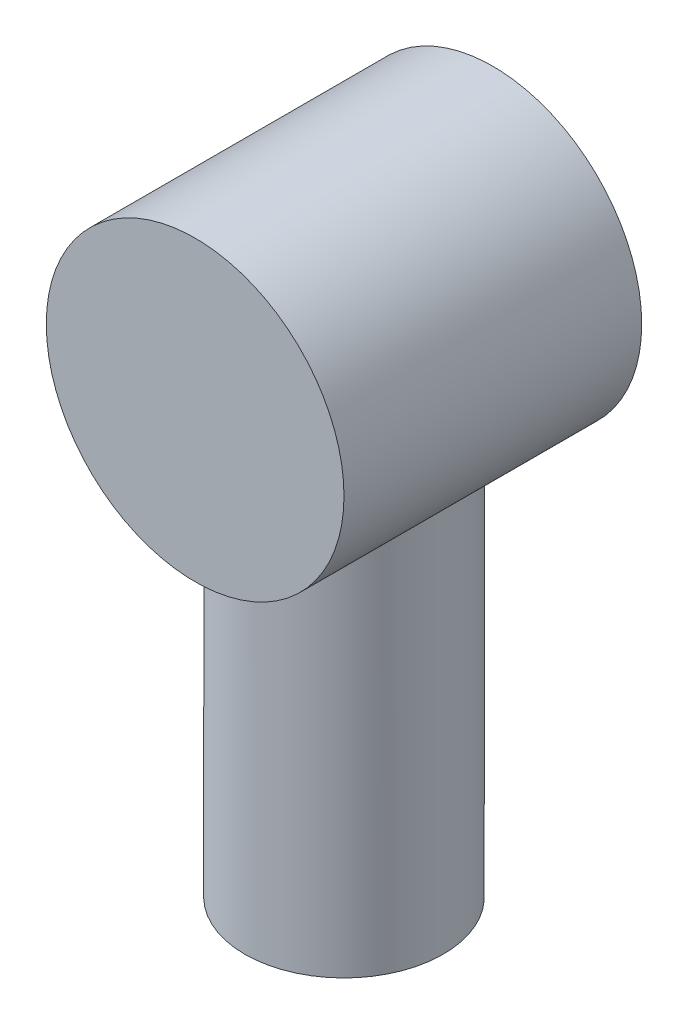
ISO-10303-21;
HEADER;
FILE_DESCRIPTION(('STEP AP214'),'2;1');
FILE_NAME('part.step','',(''),(''),'','','');
FILE_SCHEMA(('AUTOMOTIVE_DESIGN { 1 0 10303 214 1 1 1 1 }'));
ENDSEC;
DATA;
#1=APPLICATION_CONTEXT('core data for automotive mechanical design processes');
#2=APPLICATION_PROTOCOL_DEFINITION('international standard','automotive_design',2000,#1);
#3=PRODUCT_CONTEXT('',#1,'mechanical');
#4=PRODUCT('Part','Part','',(#3));
#5=PRODUCT_RELATED_PRODUCT_CATEGORY('part','',(#4));
#6=PRODUCT_DEFINITION_FORMATION('','',#4);
#7=PRODUCT_DEFINITION_CONTEXT('part definition',#1,'design');
#8=PRODUCT_DEFINITION('design','',#6,#7);
#9=PRODUCT_DEFINITION_SHAPE('','',#8);
#10=(LENGTH_UNIT() NAMED_UNIT(*) SI_UNIT(.MILLI.,.METRE.));
#11=(NAMED_UNIT(*) PLANE_ANGLE_UNIT() SI_UNIT($,.RADIAN.));
#12=(NAMED_UNIT(*) SI_UNIT($,.STERADIAN.) SOLID_ANGLE_UNIT());
#13=UNCERTAINTY_MEASURE_WITH_UNIT(LENGTH_MEASURE(1.E-05),#10,'distance_accuracy_value','');
#14=(GEOMETRIC_REPRESENTATION_CONTEXT(3) GLOBAL_UNCERTAINTY_ASSIGNED_CONTEXT((#13)) GLOBAL_UNIT_ASSIGNED_CONTEXT((#10,
#11,#12)) REPRESENTATION_CONTEXT('',''));
#15=CARTESIAN_POINT('',(0.,0.,0.));
#16=DIRECTION('',(0.,0.,1.));
#17=DIRECTION('',(1.,0.,0.));
#18=AXIS2_PLACEMENT_3D('',#15,#16,#17);
#19=CARTESIAN_POINT('',(0.,0.,-75.));
#20=DIRECTION('',(0.,0.,1.));
#21=DIRECTION('',(1.,0.,0.));
#22=AXIS2_PLACEMENT_3D('',#19,#20,#21);
#23=CYLINDRICAL_SURFACE('',#22,75.);
#24=CARTESIAN_POINT('',(0.,-75.,50.));
#25=CARTESIAN_POINT('',(-1.25607912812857,-74.9999993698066,49.9999992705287));
#26=CARTESIAN_POINT('',(-2.51216621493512,-74.9683781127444,49.9526046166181));
#27=CARTESIAN_POINT('',(-5.01407179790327,-74.8426887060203,49.7637718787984));
#28=CARTESIAN_POINT('',(-6.25989023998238,-74.7486202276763,49.6223332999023));
#29=CARTESIAN_POINT('',(-8.73197178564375,-74.5003130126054,49.2475006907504));
#30=CARTESIAN_POINT('',(-9.95822707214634,-74.3460508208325,49.0140708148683));
#31=CARTESIAN_POINT('',(-12.3818417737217,-73.9810246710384,48.4585988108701));
#32=CARTESIAN_POINT('',(-13.5792008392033,-73.7702600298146,48.1365556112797));
#33=CARTESIAN_POINT('',(-15.9317078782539,-73.2981128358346,47.4098011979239));
#34=CARTESIAN_POINT('',(-17.0870301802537,-73.0369769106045,47.0054922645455));
#35=CARTESIAN_POINT('',(-19.3551767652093,-72.4689183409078,46.1178965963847));
#36=CARTESIAN_POINT('',(-20.4680012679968,-72.1619959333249,45.6346102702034));
#37=CARTESIAN_POINT('',(-22.6461387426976,-71.5083591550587,44.5938272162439));
#38=CARTESIAN_POINT('',(-23.7114516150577,-71.1616447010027,44.0363303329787));
#39=CARTESIAN_POINT('',(-25.790674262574,-70.4347519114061,42.851755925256));
#40=CARTESIAN_POINT('',(-26.8045815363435,-70.0545719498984,42.2246750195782));
#41=CARTESIAN_POINT('',(-28.861666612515,-69.2338946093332,40.849261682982));
#42=CARTESIAN_POINT('',(-29.9000336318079,-68.7910162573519,40.0951562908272));
#43=CARTESIAN_POINT('',(-31.9096887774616,-67.8821640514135,38.5150098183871));
#44=CARTESIAN_POINT('',(-32.8809738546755,-67.4161891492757,37.6889654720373));
#45=CARTESIAN_POINT('',(-34.7552786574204,-66.4693490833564,35.96792388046));
#46=CARTESIAN_POINT('',(-35.6582055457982,-65.9884648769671,35.0728360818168));
#47=CARTESIAN_POINT('',(-37.3921493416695,-65.0216326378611,33.2180538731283));
#48=CARTESIAN_POINT('',(-38.2231619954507,-64.5356843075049,32.2583556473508));
#49=CARTESIAN_POINT('',(-39.9363542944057,-63.4920916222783,30.1205689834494));
#50=CARTESIAN_POINT('',(-40.8058966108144,-62.9352413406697,28.9319232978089));
#51=CARTESIAN_POINT('',(-42.4412194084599,-61.8442348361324,26.4749144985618));
#52=CARTESIAN_POINT('',(-43.2069763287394,-61.3100837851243,25.2065333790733));
#53=CARTESIAN_POINT('',(-44.6279110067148,-60.2836354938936,22.595480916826));
#54=CARTESIAN_POINT('',(-45.2832388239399,-59.7912819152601,21.2529137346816));
#55=CARTESIAN_POINT('',(-46.477113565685,-58.8680528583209,18.4967747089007));
#56=CARTESIAN_POINT('',(-47.0157165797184,-58.4371478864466,17.0832373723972));
#57=CARTESIAN_POINT('',(-47.830072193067,-57.7708886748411,14.6101230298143));
#58=CARTESIAN_POINT('',(-48.1368155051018,-57.5149970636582,13.5662004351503));
#59=CARTESIAN_POINT('',(-48.6835315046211,-57.0529757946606,11.4502022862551));
#60=CARTESIAN_POINT('',(-48.9235150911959,-56.8468380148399,10.3781313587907));
#61=CARTESIAN_POINT('',(-49.3331558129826,-56.4917106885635,8.21290481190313));
#62=CARTESIAN_POINT('',(-49.5029168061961,-56.3426367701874,7.11978285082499));
#63=CARTESIAN_POINT('',(-49.7699049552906,-56.1069379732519,4.91794365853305));
#64=CARTESIAN_POINT('',(-49.867131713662,-56.0203134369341,3.80922634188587));
#65=CARTESIAN_POINT('',(-49.9875475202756,-55.9128944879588,1.57993457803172));
#66=CARTESIAN_POINT('',(-50.0104283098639,-55.8923741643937,0.459330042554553));
#67=CARTESIAN_POINT('',(-49.9808494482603,-55.9188255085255,-1.780076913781));
#68=CARTESIAN_POINT('',(-49.9283895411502,-55.9657974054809,-2.898879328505));
#69=CARTESIAN_POINT('',(-49.7490517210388,-56.1252713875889,-5.12656174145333));
#70=CARTESIAN_POINT('',(-49.6221185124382,-56.2378221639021,-6.23543374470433));
#71=CARTESIAN_POINT('',(-49.2960030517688,-56.523896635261,-8.43444104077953));
#72=CARTESIAN_POINT('',(-49.096819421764,-56.6974214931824,-9.52457597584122));
#73=CARTESIAN_POINT('',(-48.6396771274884,-57.0900007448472,-11.6315017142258));
#74=CARTESIAN_POINT('',(-48.3847316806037,-57.3066828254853,-12.649396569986));
#75=CARTESIAN_POINT('',(-47.8145330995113,-57.7832883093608,-14.6581382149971));
#76=CARTESIAN_POINT('',(-47.4992566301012,-58.0432284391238,-15.6489743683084));
#77=CARTESIAN_POINT('',(-46.8113917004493,-58.5993950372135,-17.6001100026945));
#78=CARTESIAN_POINT('',(-46.438797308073,-58.8956252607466,-18.5604063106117));
#79=CARTESIAN_POINT('',(-45.6391782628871,-59.5174078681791,-20.4478801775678));
#80=CARTESIAN_POINT('',(-45.2121657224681,-59.8429537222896,-21.3750650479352));
#81=CARTESIAN_POINT('',(-44.2137646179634,-60.5855151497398,-23.3803350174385));
#82=CARTESIAN_POINT('',(-43.6306819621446,-61.0076592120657,-24.4507093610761));
#83=CARTESIAN_POINT('',(-42.3925789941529,-61.8743922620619,-26.5394717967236));
#84=CARTESIAN_POINT('',(-41.7375518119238,-62.3189833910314,-27.557854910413));
#85=CARTESIAN_POINT('',(-40.3576530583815,-63.2213580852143,-29.5418590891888));
#86=CARTESIAN_POINT('',(-39.6327054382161,-63.6791556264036,-30.5074208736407));
#87=CARTESIAN_POINT('',(-38.1158937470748,-64.5984937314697,-32.3826047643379));
#88=CARTESIAN_POINT('',(-37.3240252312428,-65.0600345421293,-33.2922231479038));
#89=CARTESIAN_POINT('',(-35.4973720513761,-66.0776235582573,-35.2432553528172));
#90=CARTESIAN_POINT('',(-34.4470402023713,-66.6325757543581,-36.2707577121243));
#91=CARTESIAN_POINT('',(-32.2536688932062,-67.7214915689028,-38.2343790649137));
#92=CARTESIAN_POINT('',(-31.1106124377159,-68.255451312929,-39.1704812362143));
#93=CARTESIAN_POINT('',(-28.7367153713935,-69.2883502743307,-40.9437956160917));
#94=CARTESIAN_POINT('',(-27.5059401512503,-69.7873150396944,-41.7810802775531));
#95=CARTESIAN_POINT('',(-24.9611838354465,-70.7374190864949,-43.3494130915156));
#96=CARTESIAN_POINT('',(-23.6472257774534,-71.1885715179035,-44.0804904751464));
#97=CARTESIAN_POINT('',(-21.2083653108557,-71.9479110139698,-45.2954763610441));
#98=CARTESIAN_POINT('',(-20.0968929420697,-72.2667869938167,-45.7997439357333));
#99=CARTESIAN_POINT('',(-17.8296258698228,-72.85929326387,-46.7290579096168));
#100=CARTESIAN_POINT('',(-16.6738363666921,-73.1329288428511,-47.1541135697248));
#101=CARTESIAN_POINT('',(-14.3248068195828,-73.629069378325,-47.9199844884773));
#102=CARTESIAN_POINT('',(-13.1315925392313,-73.8516086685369,-48.2608563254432));
#103=CARTESIAN_POINT('',(-10.7143858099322,-74.2408263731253,-48.8543809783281));
#104=CARTESIAN_POINT('',(-9.49039288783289,-74.4075039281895,-49.1070324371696));
#105=CARTESIAN_POINT('',(-7.01493285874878,-74.6816447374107,-49.5214332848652));
#106=CARTESIAN_POINT('',(-5.76336899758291,-74.7888458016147,-49.6827802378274));
#107=CARTESIAN_POINT('',(-3.24779978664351,-74.9402390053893,-49.9103863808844));
#108=CARTESIAN_POINT('',(-1.98379442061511,-74.9844310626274,-49.9766454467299));
#109=CARTESIAN_POINT('',(0.546161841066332,-75.0086794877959,-50.0130200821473));
#110=CARTESIAN_POINT('',(1.81211265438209,-74.9887384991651,-49.9831396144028));
#111=CARTESIAN_POINT('',(4.33545391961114,-74.8852333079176,-49.8277186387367));
#112=CARTESIAN_POINT('',(5.59284473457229,-74.8016718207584,-49.7021822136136));
#113=CARTESIAN_POINT('',(8.0010544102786,-74.5811036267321,-49.3695781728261));
#114=CARTESIAN_POINT('',(9.15314529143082,-74.4482725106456,-49.1688708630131));
#115=CARTESIAN_POINT('',(11.4337539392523,-74.1322766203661,-48.6890852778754));
#116=CARTESIAN_POINT('',(12.5622730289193,-73.949114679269,-48.4100114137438));
#117=CARTESIAN_POINT('',(14.7892901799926,-73.5361116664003,-47.7767443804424));
#118=CARTESIAN_POINT('',(15.8877862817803,-73.3062675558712,-47.422546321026));
#119=CARTESIAN_POINT('',(18.0491596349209,-72.8042512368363,-46.6427698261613));
#120=CARTESIAN_POINT('',(19.1120349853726,-72.5320767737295,-46.217187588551));
#121=CARTESIAN_POINT('',(21.2606669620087,-71.9326221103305,-45.2707880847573));
#122=CARTESIAN_POINT('',(22.3439174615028,-71.6030042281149,-44.7457668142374));
#123=CARTESIAN_POINT('',(24.4608128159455,-70.9077575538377,-43.6245744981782));
#124=CARTESIAN_POINT('',(25.4944561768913,-70.5421276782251,-43.0284013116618));
#125=CARTESIAN_POINT('',(27.5092556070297,-69.7810939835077,-41.7690428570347));
#126=CARTESIAN_POINT('',(28.4903864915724,-69.3856760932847,-41.10582586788));
#127=CARTESIAN_POINT('',(30.3970494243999,-68.5718169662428,-39.7166332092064));
#128=CARTESIAN_POINT('',(31.3225783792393,-68.1533744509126,-38.9906540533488));
#129=CARTESIAN_POINT('',(33.2578367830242,-67.2327199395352,-37.3598822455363));
#130=CARTESIAN_POINT('',(34.2577309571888,-66.7277262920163,-36.4449686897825));
#131=CARTESIAN_POINT('',(36.1774209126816,-65.7067457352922,-34.5401662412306));
#132=CARTESIAN_POINT('',(37.0972060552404,-65.1907573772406,-33.5502674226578));
#133=CARTESIAN_POINT('',(38.8544700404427,-64.1589349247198,-31.4985058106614));
#134=CARTESIAN_POINT('',(39.6918925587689,-63.6431011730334,-30.4365945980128));
#135=CARTESIAN_POINT('',(41.2805689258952,-62.6243153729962,-28.2444115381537));
#136=CARTESIAN_POINT('',(42.0318315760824,-62.121362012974,-27.1141466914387));
#137=CARTESIAN_POINT('',(43.3846567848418,-61.1832557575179,-24.8862068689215));
#138=CARTESIAN_POINT('',(43.993506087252,-60.745965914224,-23.7938574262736));
#139=CARTESIAN_POINT('',(45.1321365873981,-59.9048518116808,-21.5561130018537));
#140=CARTESIAN_POINT('',(45.6619166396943,-59.5010280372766,-20.4107172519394));
#141=CARTESIAN_POINT('',(46.6370927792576,-58.7397976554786,-18.0716535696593));
#142=CARTESIAN_POINT('',(47.0826123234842,-58.3823233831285,-16.8780594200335));
#143=CARTESIAN_POINT('',(47.8848711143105,-57.7261478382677,-14.4456870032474));
#144=CARTESIAN_POINT('',(48.2416307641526,-57.4274330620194,-13.2069191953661));
#145=CARTESIAN_POINT('',(48.8051035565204,-56.9488612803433,-10.9174566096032));
#146=CARTESIAN_POINT('',(49.0272622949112,-56.7572902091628,-9.87300003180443));
#147=CARTESIAN_POINT('',(49.4051907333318,-56.4286284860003,-7.76367173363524));
#148=CARTESIAN_POINT('',(49.5609684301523,-56.2915312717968,-6.698802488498));
#149=CARTESIAN_POINT('',(49.8036343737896,-56.0769505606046,-4.55622797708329));
#150=CARTESIAN_POINT('',(49.8905860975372,-55.9994121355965,-3.47853547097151));
#151=CARTESIAN_POINT('',(49.9943596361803,-55.9067879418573,-1.317047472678));
#152=CARTESIAN_POINT('',(50.0111804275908,-55.8917030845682,-0.23325189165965));
#153=CARTESIAN_POINT('',(49.9743764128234,-55.9246124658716,1.93278821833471));
#154=CARTESIAN_POINT('',(49.920711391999,-55.9726427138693,3.01503150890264));
#155=CARTESIAN_POINT('',(49.743813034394,-56.1299110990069,5.16925653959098));
#156=CARTESIAN_POINT('',(49.6205802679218,-56.2391487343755,6.24123836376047));
#157=CARTESIAN_POINT('',(49.3063738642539,-56.5148212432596,8.36895492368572));
#158=CARTESIAN_POINT('',(49.1153231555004,-56.6813211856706,9.42466974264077));
#159=CARTESIAN_POINT('',(48.668246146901,-57.0656505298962,11.5127029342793));
#160=CARTESIAN_POINT('',(48.4122115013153,-57.2834865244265,12.5450182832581));
#161=CARTESIAN_POINT('',(47.7617121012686,-57.8277047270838,14.8530792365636));
#162=CARTESIAN_POINT('',(47.3485400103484,-58.1675437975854,16.1204019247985));
#163=CARTESIAN_POINT('',(46.4290551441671,-58.9040695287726,18.6036912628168));
#164=CARTESIAN_POINT('',(45.9227166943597,-59.3007718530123,19.8196436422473));
#165=CARTESIAN_POINT('',(44.821920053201,-60.1371237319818,22.1971494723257));
#166=CARTESIAN_POINT('',(44.2273676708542,-60.5768190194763,23.3586430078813));
#167=CARTESIAN_POINT('',(42.9552127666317,-61.485450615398,25.6229623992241));
#168=CARTESIAN_POINT('',(42.2776146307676,-61.9543853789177,26.7257913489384));
#169=CARTESIAN_POINT('',(40.8299760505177,-62.9180640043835,28.8901139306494));
#170=CARTESIAN_POINT('',(40.0584799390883,-63.4131219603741,29.9504927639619));
#171=CARTESIAN_POINT('',(38.4362771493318,-64.4093060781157,32.0057265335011));
#172=CARTESIAN_POINT('',(37.5855706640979,-64.9104322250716,33.0005816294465));
#173=CARTESIAN_POINT('',(35.8072393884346,-65.9081269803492,34.9221349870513));
#174=CARTESIAN_POINT('',(34.8795925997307,-66.404694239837,35.848813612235));
#175=CARTESIAN_POINT('',(32.9500596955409,-67.3829668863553,37.6300151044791));
#176=CARTESIAN_POINT('',(31.9481674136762,-67.8646710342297,38.4845319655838));
#177=CARTESIAN_POINT('',(29.7231744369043,-68.8711034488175,40.2344703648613));
#178=CARTESIAN_POINT('',(28.4889830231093,-69.3920555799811,41.1180993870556));
#179=CARTESIAN_POINT('',(26.571536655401,-70.1386126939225,42.3619471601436));
#180=CARTESIAN_POINT('',(25.9211928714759,-70.3817088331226,42.7630525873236));
#181=CARTESIAN_POINT('',(24.5992016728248,-70.8545815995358,43.5369458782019));
#182=CARTESIAN_POINT('',(23.9275571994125,-71.0843600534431,43.9097376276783));
#183=CARTESIAN_POINT('',(22.5646154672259,-71.5286753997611,44.6254411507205));
#184=CARTESIAN_POINT('',(21.8733399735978,-71.7432283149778,44.9683844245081));
#185=CARTESIAN_POINT('',(20.4716502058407,-72.1557008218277,45.6235677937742));
#186=CARTESIAN_POINT('',(19.7612386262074,-72.3536227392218,45.9358121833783));
#187=CARTESIAN_POINT('',(18.3226242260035,-72.7312468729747,46.5283397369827));
#188=CARTESIAN_POINT('',(17.5944252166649,-72.9109529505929,46.8086296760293));
#189=CARTESIAN_POINT('',(16.1217137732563,-73.2506766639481,47.3360566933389));
#190=CARTESIAN_POINT('',(15.3772025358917,-73.4106957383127,47.5831961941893));
#191=CARTESIAN_POINT('',(13.455759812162,-73.7927029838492,48.1709174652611));
#192=CARTESIAN_POINT('',(12.2682623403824,-73.9997650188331,48.4871890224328));
#193=CARTESIAN_POINT('',(9.86541480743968,-74.3582490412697,49.0325542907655));
#194=CARTESIAN_POINT('',(8.65006927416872,-74.5096800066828,49.2616620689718));
#195=CARTESIAN_POINT('',(6.20060249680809,-74.7533681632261,49.6294778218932));
#196=CARTESIAN_POINT('',(4.9664933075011,-74.8456618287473,49.7682415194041));
#197=CARTESIAN_POINT('',(2.48825893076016,-74.9689792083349,49.9535047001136));
#198=CARTESIAN_POINT('',(1.24413336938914,-75.0000006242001,50.0000007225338));
#199=CARTESIAN_POINT('',(0.,-75.,50.));
#200=B_SPLINE_CURVE_WITH_KNOTS('',3,(#24,#25,#26,#27,#28,#29,#30,#31,#32,#33,#34,#35,#36,#37,
#38,#39,#40,#41,#42,#43,#44,#45,#46,#47,#48,#49,#50,#51,#52,#53,#54,#55,#56,#57,#58,#59,#60,#61,
#62,#63,#64,#65,#66,#67,#68,#69,#70,#71,#72,#73,#74,#75,#76,#77,#78,#79,#80,#81,#82,#83,#84,#85,
#86,#87,#88,#89,#90,#91,#92,#93,#94,#95,#96,#97,#98,#99,#100,#101,#102,#103,#104,#105,#106,#107,
#108,#109,#110,#111,#112,#113,#114,#115,#116,#117,#118,#119,#120,#121,#122,#123,#124,#125,#126,
#127,#128,#129,#130,#131,#132,#133,#134,#135,#136,#137,#138,#139,#140,#141,#142,#143,#144,#145,
#146,#147,#148,#149,#150,#151,#152,#153,#154,#155,#156,#157,#158,#159,#160,#161,#162,#163,#164,
#165,#166,#167,#168,#169,#170,#171,#172,#173,#174,#175,#176,#177,#178,#179,#180,#181,#182,#183,
#184,#185,#186,#187,#188,#189,#190,#191,#192,#193,#194,#195,#196,#197,#198,#199),.UNSPECIFIED.,
.T.,.F.,(4,2,2,2,2,2,2,2,2,2,2,2,2,2,2,2,2,2,2,2,2,2,2,2,2,2,2,2,2,2,2,2,2,2,2,2,2,2,2,2,2,2,2,
2,2,2,2,2,2,2,2,2,2,2,2,2,2,2,2,2,2,2,2,2,2,2,2,2,2,2,2,2,2,2,2,2,2,2,2,2,2,2,2,2,2,2,2,4),(0.,
3.76697150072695,7.53396282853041,11.3024234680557,15.0709296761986,18.8214325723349,
22.5719160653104,26.3224074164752,30.0730810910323,34.141861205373,38.2108261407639,
42.2852215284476,46.3598577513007,51.0778298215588,55.7968711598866,60.5094472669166,
65.219753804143,68.56991274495,71.9195244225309,75.2641642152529,78.6088223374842,
81.9673307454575,85.3258505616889,88.6868672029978,92.0479479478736,95.2593158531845,
98.4719283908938,101.684873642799,104.897105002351,108.763339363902,112.62994323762,
116.500801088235,120.371916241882,125.078303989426,129.785556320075,134.489335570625,
139.191817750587,142.972498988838,146.752737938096,150.530429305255,154.308178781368,
158.102451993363,161.896730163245,165.6908519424,169.484811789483,173.011740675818,
176.538471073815,180.06543111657,183.592579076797,187.333121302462,191.073776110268,
194.816209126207,198.5588501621,202.893439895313,207.228604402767,211.566713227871,
215.904378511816,219.875264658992,223.846208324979,227.811287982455,231.775455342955,
235.026760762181,238.277674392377,241.525586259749,244.773545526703,248.023358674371,
251.273145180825,254.526636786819,257.780546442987,261.90140788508,266.023406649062,
270.149838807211,274.276053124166,278.47722241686,282.678381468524,286.880745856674,
291.083459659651,295.890616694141,298.295380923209,300.699814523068,303.101679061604,
305.503207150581,307.904225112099,310.305067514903,314.038981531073,317.772292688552,
321.503299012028,325.23444527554),.UNSPECIFIED.);
#201=CARTESIAN_POINT('',(0.,-75.,50.));
#202=VERTEX_POINT('',#201);
#203=EDGE_CURVE('E10',#202,#202,#200,.T.);
#204=ORIENTED_EDGE('',*,*,#203,.F.);
#205=EDGE_LOOP('',(#204));
#206=FACE_BOUND('',#205,.T.);
#207=CARTESIAN_POINT('',(0.,0.,-75.));
#208=DIRECTION('',(0.,0.,1.));
#209=DIRECTION('',(1.,0.,0.));
#210=AXIS2_PLACEMENT_3D('',#207,#208,#209);
#211=CIRCLE('',#210,75.);
#212=CARTESIAN_POINT('',(75.,0.,-75.));
#213=VERTEX_POINT('',#212);
#214=EDGE_CURVE('E42',#213,#213,#211,.T.);
#215=ORIENTED_EDGE('',*,*,#214,.T.);
#216=EDGE_LOOP('',(#215));
#217=FACE_BOUND('',#216,.T.);
#218=CARTESIAN_POINT('',(0.,0.,75.));
#219=DIRECTION('',(0.,0.,1.));
#220=DIRECTION('',(1.,0.,0.));
#221=AXIS2_PLACEMENT_3D('',#218,#219,#220);
#222=CIRCLE('',#221,75.);
#223=CARTESIAN_POINT('',(75.,0.,75.));
#224=VERTEX_POINT('',#223);
#225=EDGE_CURVE('E46',#224,#224,#222,.T.);
#226=ORIENTED_EDGE('',*,*,#225,.F.);
#227=EDGE_LOOP('',(#226));
#228=FACE_BOUND('',#227,.T.);
#229=ADVANCED_FACE('F32',(#206,#217,#228),#23,.T.);
#230=CARTESIAN_POINT('',(0.,0.,-75.));
#231=DIRECTION('',(0.,0.,1.));
#232=DIRECTION('',(1.,0.,0.));
#233=AXIS2_PLACEMENT_3D('',#230,#231,#232);
#234=PLANE('',#233);
#235=ORIENTED_EDGE('',*,*,#214,.F.);
#236=EDGE_LOOP('',(#235));
#237=FACE_BOUND('',#236,.T.);
#238=ADVANCED_FACE('F66',(#237),#234,.F.);
#239=CARTESIAN_POINT('',(0.,0.,75.));
#240=DIRECTION('',(0.,0.,1.));
#241=DIRECTION('',(1.,0.,0.));
#242=AXIS2_PLACEMENT_3D('',#239,#240,#241);
#243=PLANE('',#242);
#244=ORIENTED_EDGE('',*,*,#225,.T.);
#245=EDGE_LOOP('',(#244));
#246=FACE_BOUND('',#245,.T.);
#247=ADVANCED_FACE('F64',(#246),#243,.T.);
#248=CARTESIAN_POINT('',(0.,-250.,0.));
#249=DIRECTION('',(0.,1.,0.));
#250=DIRECTION('',(0.,0.,1.));
#251=AXIS2_PLACEMENT_3D('',#248,#249,#250);
#252=CYLINDRICAL_SURFACE('',#251,50.);
#253=ORIENTED_EDGE('',*,*,#203,.T.);
#254=EDGE_LOOP('',(#253));
#255=FACE_BOUND('',#254,.T.);
#256=CARTESIAN_POINT('',(0.,-250.,0.));
#257=DIRECTION('',(0.,1.,0.));
#258=DIRECTION('',(0.,0.,1.));
#259=AXIS2_PLACEMENT_3D('',#256,#257,#258);
#260=CIRCLE('',#259,50.);
#261=CARTESIAN_POINT('',(0.,-250.,50.));
#262=VERTEX_POINT('',#261);
#263=EDGE_CURVE('E50',#262,#262,#260,.T.);
#264=ORIENTED_EDGE('',*,*,#263,.T.);
#265=EDGE_LOOP('',(#264));
#266=FACE_BOUND('',#265,.T.);
#267=ADVANCED_FACE('F56',(#255,#266),#252,.T.);
#268=CARTESIAN_POINT('',(0.,-250.,0.));
#269=DIRECTION('',(0.,1.,0.));
#270=DIRECTION('',(0.,0.,1.));
#271=AXIS2_PLACEMENT_3D('',#268,#269,#270);
#272=PLANE('',#271);
#273=ORIENTED_EDGE('',*,*,#263,.F.);
#274=EDGE_LOOP('',(#273));
#275=FACE_BOUND('',#274,.T.);
#276=ADVANCED_FACE('F58',(#275),#272,.F.);
#277=CLOSED_SHELL('',(#229,#238,#247,#267,#276));
#278=MANIFOLD_SOLID_BREP('B2',#277);
#279=ADVANCED_BREP_SHAPE_REPRESENTATION('',(#18,#278),#14);
#280=SHAPE_DEFINITION_REPRESENTATION(#9,#279);
ENDSEC;
END-ISO-10303-21;
